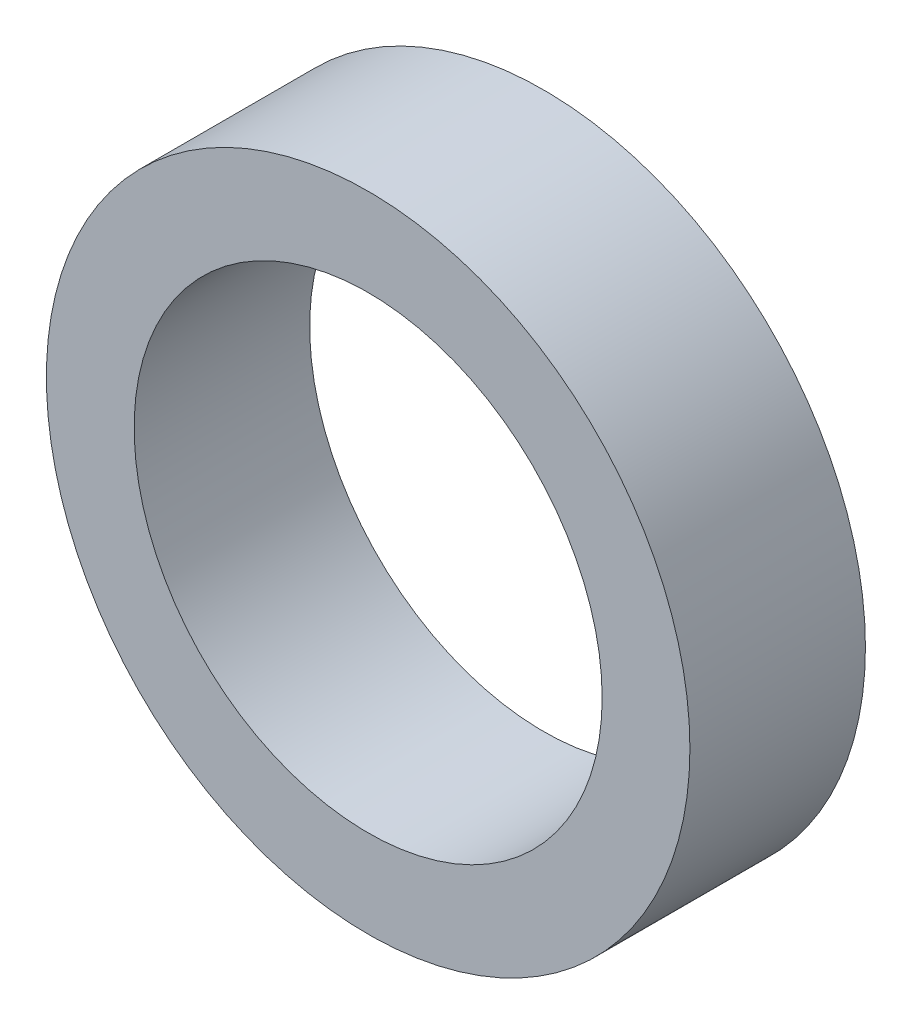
ISO-10303-21;
HEADER;
FILE_DESCRIPTION(('STEP AP214'),'2;1');
FILE_NAME('part.step','',(''),(''),'','','');
FILE_SCHEMA(('AUTOMOTIVE_DESIGN { 1 0 10303 214 1 1 1 1 }'));
ENDSEC;
DATA;
#1=APPLICATION_CONTEXT('core data for automotive mechanical design processes');
#2=APPLICATION_PROTOCOL_DEFINITION('international standard','automotive_design',2000,#1);
#3=PRODUCT_CONTEXT('',#1,'mechanical');
#4=PRODUCT('Part','Part','',(#3));
#5=PRODUCT_RELATED_PRODUCT_CATEGORY('part','',(#4));
#6=PRODUCT_DEFINITION_FORMATION('','',#4);
#7=PRODUCT_DEFINITION_CONTEXT('part definition',#1,'design');
#8=PRODUCT_DEFINITION('design','',#6,#7);
#9=PRODUCT_DEFINITION_SHAPE('','',#8);
#10=(LENGTH_UNIT() NAMED_UNIT(*) SI_UNIT(.MILLI.,.METRE.));
#11=(NAMED_UNIT(*) PLANE_ANGLE_UNIT() SI_UNIT($,.RADIAN.));
#12=(NAMED_UNIT(*) SI_UNIT($,.STERADIAN.) SOLID_ANGLE_UNIT());
#13=UNCERTAINTY_MEASURE_WITH_UNIT(LENGTH_MEASURE(1.E-05),#10,'distance_accuracy_value','');
#14=(GEOMETRIC_REPRESENTATION_CONTEXT(3) GLOBAL_UNCERTAINTY_ASSIGNED_CONTEXT((#13)) GLOBAL_UNIT_ASSIGNED_CONTEXT((#10,
#11,#12)) REPRESENTATION_CONTEXT('',''));
#15=CARTESIAN_POINT('',(0.,0.,0.));
#16=DIRECTION('',(0.,0.,1.));
#17=DIRECTION('',(1.,0.,0.));
#18=AXIS2_PLACEMENT_3D('',#15,#16,#17);
#19=CARTESIAN_POINT('',(0.,0.,3.));
#20=DIRECTION('',(0.,0.,-1.));
#21=DIRECTION('',(0.,1.,0.));
#22=AXIS2_PLACEMENT_3D('',#19,#20,#21);
#23=CYLINDRICAL_SURFACE('',#22,4.);
#24=CARTESIAN_POINT('',(0.,0.,3.));
#25=DIRECTION('',(0.,0.,-1.));
#26=DIRECTION('',(1.,0.,0.));
#27=AXIS2_PLACEMENT_3D('',#24,#25,#26);
#28=CIRCLE('',#27,4.);
#29=CARTESIAN_POINT('',(4.,0.,3.));
#30=VERTEX_POINT('',#29);
#31=EDGE_CURVE('E8',#30,#30,#28,.T.);
#32=ORIENTED_EDGE('',*,*,#31,.F.);
#33=EDGE_LOOP('',(#32));
#34=FACE_BOUND('',#33,.T.);
#35=CARTESIAN_POINT('',(0.,0.,0.));
#36=DIRECTION('',(0.,0.,-1.));
#37=DIRECTION('',(1.,0.,0.));
#38=AXIS2_PLACEMENT_3D('',#35,#36,#37);
#39=CIRCLE('',#38,4.);
#40=CARTESIAN_POINT('',(4.,0.,0.));
#41=VERTEX_POINT('',#40);
#42=EDGE_CURVE('E23',#41,#41,#39,.T.);
#43=ORIENTED_EDGE('',*,*,#42,.T.);
#44=EDGE_LOOP('',(#43));
#45=FACE_BOUND('',#44,.T.);
#46=ADVANCED_FACE('F12',(#34,#45),#23,.F.);
#47=CARTESIAN_POINT('',(0.,0.,3.));
#48=DIRECTION('',(0.,0.,-1.));
#49=DIRECTION('',(0.,1.,0.));
#50=AXIS2_PLACEMENT_3D('',#47,#48,#49);
#51=CYLINDRICAL_SURFACE('',#50,5.5);
#52=CARTESIAN_POINT('',(0.,0.,3.));
#53=DIRECTION('',(0.,0.,-1.));
#54=DIRECTION('',(1.,0.,0.));
#55=AXIS2_PLACEMENT_3D('',#52,#53,#54);
#56=CIRCLE('',#55,5.5);
#57=CARTESIAN_POINT('',(5.5,0.,3.));
#58=VERTEX_POINT('',#57);
#59=EDGE_CURVE('E19',#58,#58,#56,.T.);
#60=ORIENTED_EDGE('',*,*,#59,.T.);
#61=EDGE_LOOP('',(#60));
#62=FACE_BOUND('',#61,.T.);
#63=CARTESIAN_POINT('',(0.,0.,0.));
#64=DIRECTION('',(0.,0.,-1.));
#65=DIRECTION('',(1.,0.,0.));
#66=AXIS2_PLACEMENT_3D('',#63,#64,#65);
#67=CIRCLE('',#66,5.5);
#68=CARTESIAN_POINT('',(5.5,0.,0.));
#69=VERTEX_POINT('',#68);
#70=EDGE_CURVE('E28',#69,#69,#67,.T.);
#71=ORIENTED_EDGE('',*,*,#70,.F.);
#72=EDGE_LOOP('',(#71));
#73=FACE_BOUND('',#72,.T.);
#74=ADVANCED_FACE('F14',(#62,#73),#51,.T.);
#75=CARTESIAN_POINT('',(0.,0.,3.));
#76=DIRECTION('',(0.,0.,-1.));
#77=DIRECTION('',(0.,1.,0.));
#78=AXIS2_PLACEMENT_3D('',#75,#76,#77);
#79=PLANE('',#78);
#80=ORIENTED_EDGE('',*,*,#31,.T.);
#81=EDGE_LOOP('',(#80));
#82=FACE_BOUND('',#81,.T.);
#83=ORIENTED_EDGE('',*,*,#59,.F.);
#84=EDGE_LOOP('',(#83));
#85=FACE_BOUND('',#84,.T.);
#86=ADVANCED_FACE('F40',(#82,#85),#79,.F.);
#87=CARTESIAN_POINT('',(0.,0.,0.));
#88=DIRECTION('',(0.,0.,-1.));
#89=DIRECTION('',(0.,1.,0.));
#90=AXIS2_PLACEMENT_3D('',#87,#88,#89);
#91=PLANE('',#90);
#92=ORIENTED_EDGE('',*,*,#42,.F.);
#93=EDGE_LOOP('',(#92));
#94=FACE_BOUND('',#93,.T.);
#95=ORIENTED_EDGE('',*,*,#70,.T.);
#96=EDGE_LOOP('',(#95));
#97=FACE_BOUND('',#96,.T.);
#98=ADVANCED_FACE('F37',(#94,#97),#91,.T.);
#99=CLOSED_SHELL('',(#46,#74,#86,#98));
#100=MANIFOLD_SOLID_BREP('B1',#99);
#101=ADVANCED_BREP_SHAPE_REPRESENTATION('',(#18,#100),#14);
#102=SHAPE_DEFINITION_REPRESENTATION(#9,#101);
ENDSEC;
END-ISO-10303-21;
